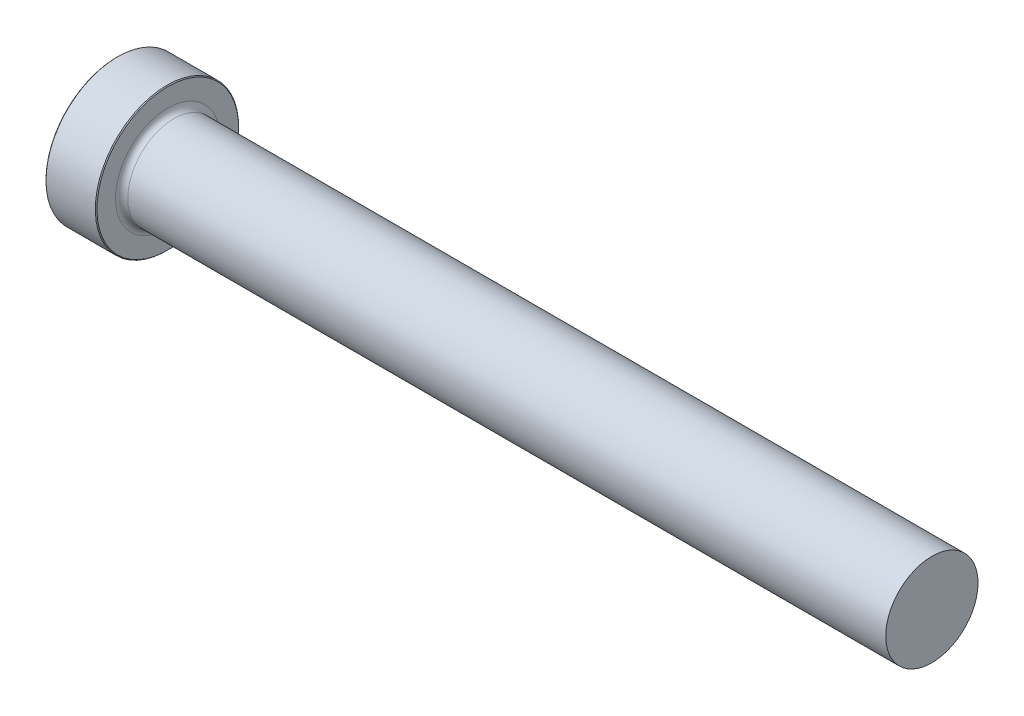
from build123d import *

# Parameters (mm, degrees)
CHAMFER1_SIZE = 0.1016


with BuildPart() as part:
    # Sketch1 → Revolve1 (revolve)
    with BuildSketch(Plane.XY):
        with BuildLine():
            Line((0, 0), (0, 8.9296875))
            Line((0, 8.9296875), (6.35, 8.9296875))
            Line((6.35, 8.9296875), (6.35, 6.5128775))
            ThreePointArc((6.35, 6.5128775), (6.573184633, 5.974062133), (7.112, 5.7508775))
            Line((7.112, 5.7508775), (101.6, 5.7508775))
            Line((101.6, 5.7508775), (101.6, 0))
            Line((101.6, 0), (0, 0))
        make_face()
    revolve(axis=Axis((101.6, 0, 0), (-1, 0, 0)))

    # Chamfer1
    chamfer1_edges = [part.edges().sort_by_distance(p)[0] for p in [
        (0, -8.9296875, 0),
        (6.35, -8.9296875, 0),
    ]]
    chamfer(chamfer1_edges, length=CHAMFER1_SIZE)


solid = part.part
